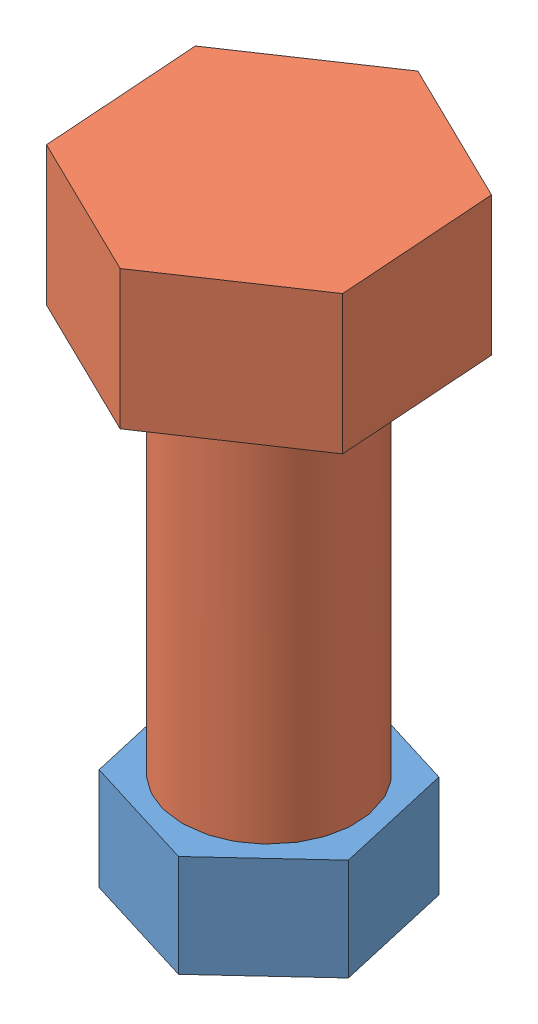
SolidWorks assembly Assem3.SLDASM, configuration Default (file format 4894). Lengths in mm.
Overall size (414.96 900 460.78).
2 component instances, 2 part files, 2 mates.
Components (placement in the parent):
- Nut-1: Nut.SLDPRT [Default] at origin size (331 147 337.74)
- Bolt-2: Bolt.SLDPRT [Default] at (0 900 0) size (414.96 900 460.78)
Mates (geometry in assembly coordinates):
- Concentric21: concentric anti-aligned: cylinder of Nut-1 through (0 147 0) axis (0 -1 0) radius 100; cylinder of Bolt-2 through (-57.0608 -318.7965 -82.1223) axis (0 1 0) radius 125
- Coincident21: coincident aligned: plane of Nut-1 through (0 0 0) normal (0 -1 0); plane of Bolt-2 through (-57.0608 -318.7965 -82.1223) normal (0 -1 0)
